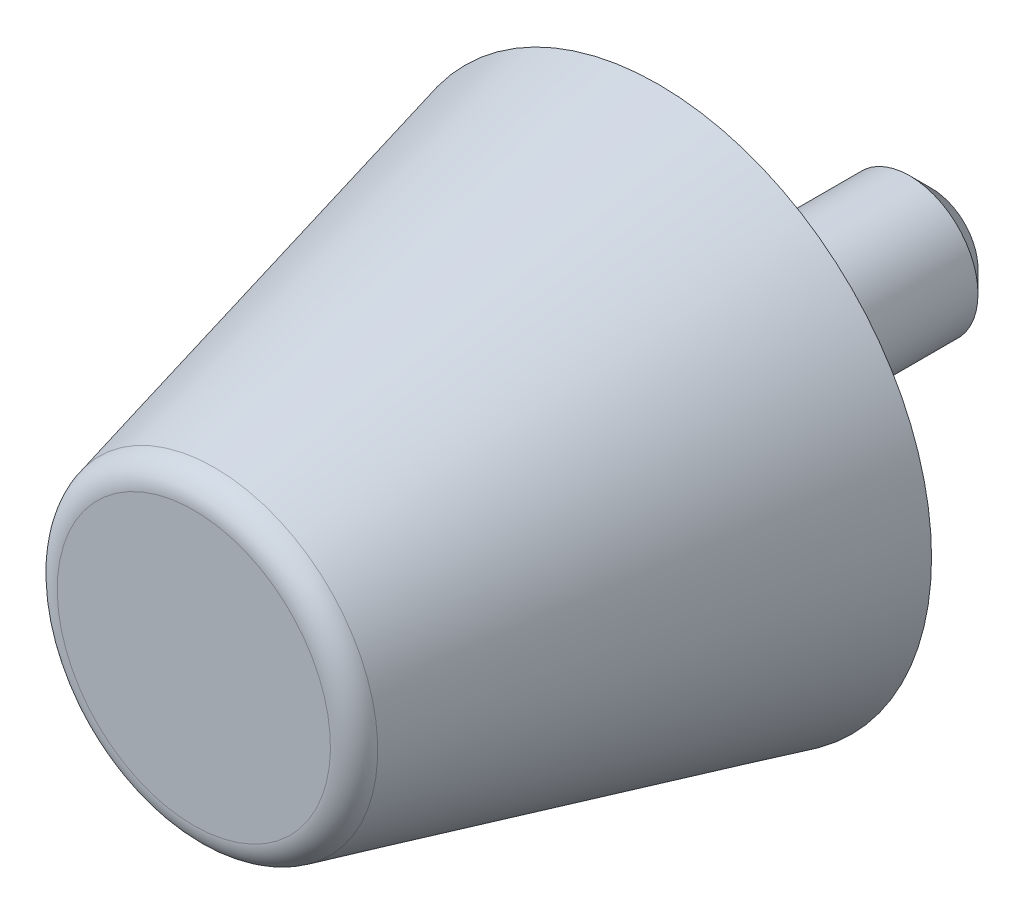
ISO-10303-21;
HEADER;
FILE_DESCRIPTION(('STEP AP214'),'2;1');
FILE_NAME('part.step','',(''),(''),'','','');
FILE_SCHEMA(('AUTOMOTIVE_DESIGN { 1 0 10303 214 1 1 1 1 }'));
ENDSEC;
DATA;
#1=APPLICATION_CONTEXT('core data for automotive mechanical design processes');
#2=APPLICATION_PROTOCOL_DEFINITION('international standard','automotive_design',2000,#1);
#3=PRODUCT_CONTEXT('',#1,'mechanical');
#4=PRODUCT('Part','Part','',(#3));
#5=PRODUCT_RELATED_PRODUCT_CATEGORY('part','',(#4));
#6=PRODUCT_DEFINITION_FORMATION('','',#4);
#7=PRODUCT_DEFINITION_CONTEXT('part definition',#1,'design');
#8=PRODUCT_DEFINITION('design','',#6,#7);
#9=PRODUCT_DEFINITION_SHAPE('','',#8);
#10=(LENGTH_UNIT() NAMED_UNIT(*) SI_UNIT(.MILLI.,.METRE.));
#11=(NAMED_UNIT(*) PLANE_ANGLE_UNIT() SI_UNIT($,.RADIAN.));
#12=(NAMED_UNIT(*) SI_UNIT($,.STERADIAN.) SOLID_ANGLE_UNIT());
#13=UNCERTAINTY_MEASURE_WITH_UNIT(LENGTH_MEASURE(1.E-05),#10,'distance_accuracy_value','');
#14=(GEOMETRIC_REPRESENTATION_CONTEXT(3) GLOBAL_UNCERTAINTY_ASSIGNED_CONTEXT((#13)) GLOBAL_UNIT_ASSIGNED_CONTEXT((#10,
#11,#12)) REPRESENTATION_CONTEXT('',''));
#15=CARTESIAN_POINT('',(0.,0.,0.));
#16=DIRECTION('',(0.,0.,1.));
#17=DIRECTION('',(1.,0.,0.));
#18=AXIS2_PLACEMENT_3D('',#15,#16,#17);
#19=CARTESIAN_POINT('',(0.,0.,17.));
#20=DIRECTION('',(0.,0.,1.));
#21=DIRECTION('',(0.,-1.,0.));
#22=AXIS2_PLACEMENT_3D('',#19,#20,#21);
#23=CYLINDRICAL_SURFACE('',#22,9.);
#24=CARTESIAN_POINT('',(0.,0.,0.));
#25=DIRECTION('',(0.,0.,1.));
#26=DIRECTION('',(0.,-1.,0.));
#27=AXIS2_PLACEMENT_3D('',#24,#25,#26);
#28=CIRCLE('',#27,9.);
#29=CARTESIAN_POINT('',(0.,-9.,0.));
#30=VERTEX_POINT('',#29);
#31=EDGE_CURVE('E27',#30,#30,#28,.T.);
#32=ORIENTED_EDGE('',*,*,#31,.F.);
#33=EDGE_LOOP('',(#32));
#34=FACE_BOUND('',#33,.T.);
#35=CARTESIAN_POINT('',(0.,0.,0.0500000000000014));
#36=DIRECTION('',(0.,0.,1.));
#37=DIRECTION('',(0.,-1.,0.));
#38=AXIS2_PLACEMENT_3D('',#35,#36,#37);
#39=CIRCLE('',#38,9.);
#40=CARTESIAN_POINT('',(0.,-9.,0.0500000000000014));
#41=VERTEX_POINT('',#40);
#42=EDGE_CURVE('E44',#41,#41,#39,.T.);
#43=ORIENTED_EDGE('',*,*,#42,.T.);
#44=EDGE_LOOP('',(#43));
#45=FACE_BOUND('',#44,.T.);
#46=ADVANCED_FACE('F12',(#34,#45),#23,.F.);
#47=CARTESIAN_POINT('',(9.,0.,0.));
#48=DIRECTION('',(0.,0.,1.));
#49=DIRECTION('',(0.,-1.,0.));
#50=AXIS2_PLACEMENT_3D('',#47,#48,#49);
#51=PLANE('',#50);
#52=CARTESIAN_POINT('',(0.,0.,0.));
#53=DIRECTION('',(0.,0.,1.));
#54=DIRECTION('',(0.,-1.,0.));
#55=AXIS2_PLACEMENT_3D('',#52,#53,#54);
#56=CIRCLE('',#55,10.);
#57=CARTESIAN_POINT('',(0.,-10.,0.));
#58=VERTEX_POINT('',#57);
#59=EDGE_CURVE('E32',#58,#58,#56,.T.);
#60=ORIENTED_EDGE('',*,*,#59,.F.);
#61=EDGE_LOOP('',(#60));
#62=FACE_BOUND('',#61,.T.);
#63=ORIENTED_EDGE('',*,*,#31,.T.);
#64=EDGE_LOOP('',(#63));
#65=FACE_BOUND('',#64,.T.);
#66=ADVANCED_FACE('F72',(#62,#65),#51,.F.);
#67=CARTESIAN_POINT('',(0.,0.,0.));
#68=DIRECTION('',(0.,0.,-1.));
#69=DIRECTION('',(0.,1.,0.));
#70=AXIS2_PLACEMENT_3D('',#67,#68,#69);
#71=CONICAL_SURFACE('',#70,10.,0.243194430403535);
#72=CARTESIAN_POINT('',(0.,0.,16.2408042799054));
#73=DIRECTION('',(0.,0.,1.));
#74=DIRECTION('',(0.,-1.,0.));
#75=AXIS2_PLACEMENT_3D('',#72,#73,#74);
#76=CIRCLE('',#75,5.97057369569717);
#77=CARTESIAN_POINT('',(0.,-5.97057369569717,16.2408042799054));
#78=VERTEX_POINT('',#77);
#79=EDGE_CURVE('E35',#78,#78,#76,.T.);
#80=ORIENTED_EDGE('',*,*,#79,.F.);
#81=EDGE_LOOP('',(#80));
#82=FACE_BOUND('',#81,.T.);
#83=ORIENTED_EDGE('',*,*,#59,.T.);
#84=EDGE_LOOP('',(#83));
#85=FACE_BOUND('',#84,.T.);
#86=ADVANCED_FACE('F77',(#82,#85),#71,.T.);
#87=CARTESIAN_POINT('',(0.,0.,16.));
#88=DIRECTION('',(0.,0.,1.));
#89=DIRECTION('',(0.,-1.,0.));
#90=AXIS2_PLACEMENT_3D('',#87,#88,#89);
#91=TOROIDAL_SURFACE('',#90,5.,1.);
#92=ORIENTED_EDGE('',*,*,#79,.T.);
#93=EDGE_LOOP('',(#92));
#94=FACE_BOUND('',#93,.T.);
#95=CARTESIAN_POINT('',(0.,0.,17.));
#96=DIRECTION('',(0.,0.,1.));
#97=DIRECTION('',(0.,-1.,0.));
#98=AXIS2_PLACEMENT_3D('',#95,#96,#97);
#99=CIRCLE('',#98,5.);
#100=CARTESIAN_POINT('',(0.,-5.,17.));
#101=VERTEX_POINT('',#100);
#102=EDGE_CURVE('E38',#101,#101,#99,.T.);
#103=ORIENTED_EDGE('',*,*,#102,.F.);
#104=EDGE_LOOP('',(#103));
#105=FACE_BOUND('',#104,.T.);
#106=ADVANCED_FACE('F84',(#94,#105),#91,.T.);
#107=CARTESIAN_POINT('',(5.,0.,17.));
#108=DIRECTION('',(0.,0.,-1.));
#109=DIRECTION('',(0.,1.,0.));
#110=AXIS2_PLACEMENT_3D('',#107,#108,#109);
#111=PLANE('',#110);
#112=ORIENTED_EDGE('',*,*,#102,.T.);
#113=EDGE_LOOP('',(#112));
#114=FACE_BOUND('',#113,.T.);
#115=ADVANCED_FACE('F59',(#114),#111,.F.);
#116=CARTESIAN_POINT('',(0.,0.,0.));
#117=DIRECTION('',(0.,0.,1.));
#118=DIRECTION('',(0.,-1.,0.));
#119=AXIS2_PLACEMENT_3D('',#116,#117,#118);
#120=PLANE('',#119);
#121=CARTESIAN_POINT('',(0.,0.,0.));
#122=DIRECTION('',(0.,0.,1.));
#123=DIRECTION('',(0.,-1.,0.));
#124=AXIS2_PLACEMENT_3D('',#121,#122,#123);
#125=CIRCLE('',#124,8.95);
#126=CARTESIAN_POINT('',(0.,-8.95,0.));
#127=VERTEX_POINT('',#126);
#128=EDGE_CURVE('E41',#127,#127,#125,.T.);
#129=ORIENTED_EDGE('',*,*,#128,.F.);
#130=EDGE_LOOP('',(#129));
#131=FACE_BOUND('',#130,.T.);
#132=CARTESIAN_POINT('',(0.,0.,0.));
#133=DIRECTION('',(0.,0.,1.));
#134=DIRECTION('',(0.,-1.,0.));
#135=AXIS2_PLACEMENT_3D('',#132,#133,#134);
#136=CIRCLE('',#135,2.5);
#137=CARTESIAN_POINT('',(0.,-2.5,0.));
#138=VERTEX_POINT('',#137);
#139=EDGE_CURVE('E23',#138,#138,#136,.T.);
#140=ORIENTED_EDGE('',*,*,#139,.T.);
#141=EDGE_LOOP('',(#140));
#142=FACE_BOUND('',#141,.T.);
#143=ADVANCED_FACE('F53',(#131,#142),#120,.F.);
#144=CARTESIAN_POINT('',(0.,0.,0.));
#145=DIRECTION('',(0.,0.,1.));
#146=DIRECTION('',(0.,-1.,0.));
#147=AXIS2_PLACEMENT_3D('',#144,#145,#146);
#148=CONICAL_SURFACE('',#147,8.95,0.785398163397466);
#149=ORIENTED_EDGE('',*,*,#42,.F.);
#150=EDGE_LOOP('',(#149));
#151=FACE_BOUND('',#150,.T.);
#152=ORIENTED_EDGE('',*,*,#128,.T.);
#153=EDGE_LOOP('',(#152));
#154=FACE_BOUND('',#153,.T.);
#155=ADVANCED_FACE('F49',(#151,#154),#148,.T.);
#156=CARTESIAN_POINT('',(0.,0.,17.));
#157=DIRECTION('',(0.,0.,1.));
#158=DIRECTION('',(0.,-1.,0.));
#159=AXIS2_PLACEMENT_3D('',#156,#157,#158);
#160=CYLINDRICAL_SURFACE('',#159,2.5);
#161=CARTESIAN_POINT('',(0.,0.,-9.2));
#162=DIRECTION('',(0.,0.,-1.));
#163=DIRECTION('',(0.,1.,0.));
#164=AXIS2_PLACEMENT_3D('',#161,#162,#163);
#165=CIRCLE('',#164,2.5);
#166=CARTESIAN_POINT('',(0.,2.5,-9.2));
#167=VERTEX_POINT('',#166);
#168=EDGE_CURVE('E8',#167,#167,#165,.F.);
#169=ORIENTED_EDGE('',*,*,#168,.T.);
#170=EDGE_LOOP('',(#169));
#171=FACE_BOUND('',#170,.T.);
#172=ORIENTED_EDGE('',*,*,#139,.F.);
#173=EDGE_LOOP('',(#172));
#174=FACE_BOUND('',#173,.T.);
#175=ADVANCED_FACE('F52',(#171,#174),#160,.T.);
#176=CARTESIAN_POINT('',(0.,0.,-10.));
#177=DIRECTION('',(0.,0.,-1.));
#178=DIRECTION('',(0.,1.,0.));
#179=AXIS2_PLACEMENT_3D('',#176,#177,#178);
#180=PLANE('',#179);
#181=CARTESIAN_POINT('',(0.,0.,-10.));
#182=DIRECTION('',(0.,0.,-1.));
#183=DIRECTION('',(0.,1.,0.));
#184=AXIS2_PLACEMENT_3D('',#181,#182,#183);
#185=CIRCLE('',#184,1.7);
#186=CARTESIAN_POINT('',(0.,1.7,-10.));
#187=VERTEX_POINT('',#186);
#188=EDGE_CURVE('E19',#187,#187,#185,.T.);
#189=ORIENTED_EDGE('',*,*,#188,.T.);
#190=EDGE_LOOP('',(#189));
#191=FACE_BOUND('',#190,.T.);
#192=ADVANCED_FACE('F64',(#191),#180,.T.);
#193=CARTESIAN_POINT('',(0.,0.,-10.));
#194=DIRECTION('',(0.,0.,1.));
#195=DIRECTION('',(0.,-1.,0.));
#196=AXIS2_PLACEMENT_3D('',#193,#194,#195);
#197=CONICAL_SURFACE('',#196,1.7,0.785398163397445);
#198=ORIENTED_EDGE('',*,*,#168,.F.);
#199=EDGE_LOOP('',(#198));
#200=FACE_BOUND('',#199,.T.);
#201=ORIENTED_EDGE('',*,*,#188,.F.);
#202=EDGE_LOOP('',(#201));
#203=FACE_BOUND('',#202,.T.);
#204=ADVANCED_FACE('F14',(#200,#203),#197,.T.);
#205=CLOSED_SHELL('',(#46,#66,#86,#106,#115,#143,#155,#175,#192,#204));
#206=MANIFOLD_SOLID_BREP('B1',#205);
#207=ADVANCED_BREP_SHAPE_REPRESENTATION('',(#18,#206),#14);
#208=SHAPE_DEFINITION_REPRESENTATION(#9,#207);
ENDSEC;
END-ISO-10303-21;
